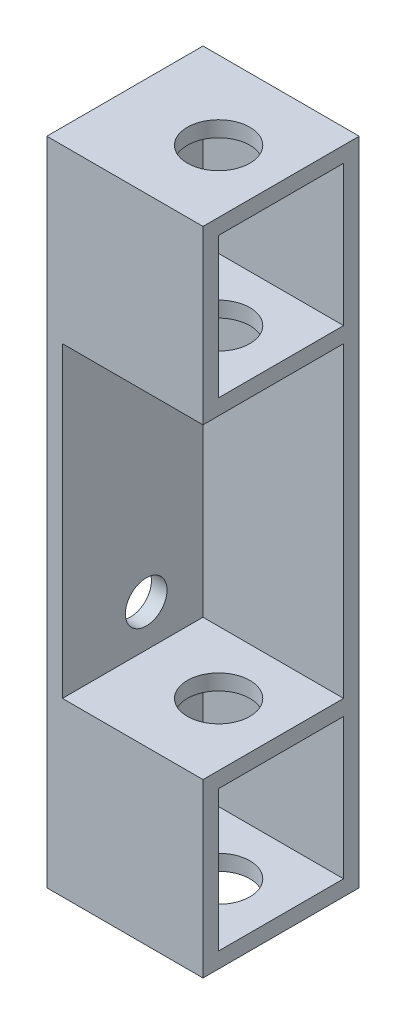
ISO-10303-21;
HEADER;
FILE_DESCRIPTION(('STEP AP214'),'2;1');
FILE_NAME('part.step','',(''),(''),'','','');
FILE_SCHEMA(('AUTOMOTIVE_DESIGN { 1 0 10303 214 1 1 1 1 }'));
ENDSEC;
DATA;
#1=APPLICATION_CONTEXT('core data for automotive mechanical design processes');
#2=APPLICATION_PROTOCOL_DEFINITION('international standard','automotive_design',2000,#1);
#3=PRODUCT_CONTEXT('',#1,'mechanical');
#4=PRODUCT('Part','Part','',(#3));
#5=PRODUCT_RELATED_PRODUCT_CATEGORY('part','',(#4));
#6=PRODUCT_DEFINITION_FORMATION('','',#4);
#7=PRODUCT_DEFINITION_CONTEXT('part definition',#1,'design');
#8=PRODUCT_DEFINITION('design','',#6,#7);
#9=PRODUCT_DEFINITION_SHAPE('','',#8);
#10=(LENGTH_UNIT() NAMED_UNIT(*) SI_UNIT(.MILLI.,.METRE.));
#11=(NAMED_UNIT(*) PLANE_ANGLE_UNIT() SI_UNIT($,.RADIAN.));
#12=(NAMED_UNIT(*) SI_UNIT($,.STERADIAN.) SOLID_ANGLE_UNIT());
#13=UNCERTAINTY_MEASURE_WITH_UNIT(LENGTH_MEASURE(1.E-05),#10,'distance_accuracy_value','');
#14=(GEOMETRIC_REPRESENTATION_CONTEXT(3) GLOBAL_UNCERTAINTY_ASSIGNED_CONTEXT((#13)) GLOBAL_UNIT_ASSIGNED_CONTEXT((#10,
#11,#12)) REPRESENTATION_CONTEXT('',''));
#15=CARTESIAN_POINT('',(0.,0.,0.));
#16=DIRECTION('',(0.,0.,1.));
#17=DIRECTION('',(1.,0.,0.));
#18=AXIS2_PLACEMENT_3D('',#15,#16,#17);
#19=CARTESIAN_POINT('',(-12.,0.,0.));
#20=DIRECTION('',(1.,0.,0.));
#21=DIRECTION('',(0.,0.,-1.));
#22=AXIS2_PLACEMENT_3D('',#19,#20,#21);
#23=PLANE('',#22);
#24=CARTESIAN_POINT('',(-12.,-21.5,-1.09322033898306));
#25=DIRECTION('',(1.,0.,0.));
#26=DIRECTION('',(0.,0.,-1.));
#27=AXIS2_PLACEMENT_3D('',#24,#25,#26);
#28=CIRCLE('',#27,4.);
#29=CARTESIAN_POINT('',(-12.,-21.5,-5.09322033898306));
#30=VERTEX_POINT('',#29);
#31=EDGE_CURVE('E487',#30,#30,#28,.T.);
#32=ORIENTED_EDGE('',*,*,#31,.F.);
#33=EDGE_LOOP('',(#32));
#34=FACE_BOUND('',#33,.T.);
#35=CARTESIAN_POINT('',(-12.,21.5,1.09322033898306));
#36=DIRECTION('',(1.,0.,0.));
#37=DIRECTION('',(0.,0.,-1.));
#38=AXIS2_PLACEMENT_3D('',#35,#36,#37);
#39=CIRCLE('',#38,4.);
#40=CARTESIAN_POINT('',(-12.,21.5,-2.90677966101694));
#41=VERTEX_POINT('',#40);
#42=EDGE_CURVE('E479',#41,#41,#39,.T.);
#43=ORIENTED_EDGE('',*,*,#42,.F.);
#44=EDGE_LOOP('',(#43));
#45=FACE_BOUND('',#44,.T.);
#46=DIRECTION('',(0.,-1.,0.));
#47=VECTOR('',#46,1.);
#48=CARTESIAN_POINT('',(-12.,62.5,-12.));
#49=LINE('',#48,#47);
#50=CARTESIAN_POINT('',(-12.,29.5,-12.));
#51=VERTEX_POINT('',#50);
#52=CARTESIAN_POINT('',(-12.,-29.5,-12.));
#53=VERTEX_POINT('',#52);
#54=EDGE_CURVE('E291',#51,#53,#49,.T.);
#55=ORIENTED_EDGE('',*,*,#54,.F.);
#56=DIRECTION('',(0.,0.,-1.));
#57=VECTOR('',#56,1.);
#58=CARTESIAN_POINT('',(-12.,29.5,15.));
#59=LINE('',#58,#57);
#60=CARTESIAN_POINT('',(-12.,29.5,15.));
#61=VERTEX_POINT('',#60);
#62=EDGE_CURVE('E178',#61,#51,#59,.T.);
#63=ORIENTED_EDGE('',*,*,#62,.F.);
#64=DIRECTION('',(0.,-1.,0.));
#65=VECTOR('',#64,1.);
#66=CARTESIAN_POINT('',(-12.,62.5,15.));
#67=LINE('',#66,#65);
#68=CARTESIAN_POINT('',(-12.,-29.5,15.));
#69=VERTEX_POINT('',#68);
#70=EDGE_CURVE('E174',#61,#69,#67,.T.);
#71=ORIENTED_EDGE('',*,*,#70,.T.);
#72=DIRECTION('',(0.,0.,1.));
#73=VECTOR('',#72,1.);
#74=CARTESIAN_POINT('',(-12.,-29.5,15.));
#75=LINE('',#74,#73);
#76=EDGE_CURVE('E210',#53,#69,#75,.T.);
#77=ORIENTED_EDGE('',*,*,#76,.F.);
#78=EDGE_LOOP('',(#55,#63,#71,#77));
#79=FACE_BOUND('',#78,.T.);
#80=ADVANCED_FACE('F39',(#34,#45,#79),#23,.T.);
#81=CARTESIAN_POINT('',(15.,62.5,-12.));
#82=DIRECTION('',(0.,0.,-1.));
#83=DIRECTION('',(0.,1.,0.));
#84=AXIS2_PLACEMENT_3D('',#81,#82,#83);
#85=PLANE('',#84);
#86=DIRECTION('',(1.,0.,0.));
#87=VECTOR('',#86,1.);
#88=CARTESIAN_POINT('',(15.,29.5,-12.));
#89=LINE('',#88,#87);
#90=CARTESIAN_POINT('',(15.,29.5,-12.));
#91=VERTEX_POINT('',#90);
#92=EDGE_CURVE('E56',#51,#91,#89,.T.);
#93=ORIENTED_EDGE('',*,*,#92,.F.);
#94=ORIENTED_EDGE('',*,*,#54,.T.);
#95=DIRECTION('',(-1.,0.,0.));
#96=VECTOR('',#95,1.);
#97=CARTESIAN_POINT('',(15.,-29.5,-12.));
#98=LINE('',#97,#96);
#99=CARTESIAN_POINT('',(15.,-29.5,-12.));
#100=VERTEX_POINT('',#99);
#101=EDGE_CURVE('E205',#100,#53,#98,.T.);
#102=ORIENTED_EDGE('',*,*,#101,.F.);
#103=DIRECTION('',(0.,-1.,0.));
#104=VECTOR('',#103,1.);
#105=CARTESIAN_POINT('',(15.,62.5,-12.));
#106=LINE('',#105,#104);
#107=EDGE_CURVE('E284',#91,#100,#106,.T.);
#108=ORIENTED_EDGE('',*,*,#107,.F.);
#109=EDGE_LOOP('',(#93,#94,#102,#108));
#110=FACE_BOUND('',#109,.T.);
#111=ADVANCED_FACE('F351',(#110),#85,.F.);
#112=CARTESIAN_POINT('',(-12.,-32.5,-12.));
#113=VERTEX_POINT('',#112);
#114=CARTESIAN_POINT('',(-12.,-59.5,-12.));
#115=VERTEX_POINT('',#114);
#116=EDGE_CURVE('E271',#113,#115,#49,.T.);
#117=ORIENTED_EDGE('',*,*,#116,.F.);
#118=DIRECTION('',(0.,0.,1.));
#119=VECTOR('',#118,1.);
#120=CARTESIAN_POINT('',(-12.,-32.5,15.));
#121=LINE('',#120,#119);
#122=CARTESIAN_POINT('',(-12.,-32.5,12.));
#123=VERTEX_POINT('',#122);
#124=EDGE_CURVE('E206',#113,#123,#121,.T.);
#125=ORIENTED_EDGE('',*,*,#124,.T.);
#126=DIRECTION('',(0.,1.,0.));
#127=VECTOR('',#126,1.);
#128=CARTESIAN_POINT('',(-12.,0.,12.));
#129=LINE('',#128,#127);
#130=CARTESIAN_POINT('',(-12.,-59.5,12.));
#131=VERTEX_POINT('',#130);
#132=EDGE_CURVE('E246',#131,#123,#129,.T.);
#133=ORIENTED_EDGE('',*,*,#132,.F.);
#134=DIRECTION('',(0.,0.,1.));
#135=VECTOR('',#134,1.);
#136=CARTESIAN_POINT('',(-12.,-59.5,0.));
#137=LINE('',#136,#135);
#138=EDGE_CURVE('E231',#115,#131,#137,.T.);
#139=ORIENTED_EDGE('',*,*,#138,.F.);
#140=EDGE_LOOP('',(#117,#125,#133,#139));
#141=FACE_BOUND('',#140,.T.);
#142=ADVANCED_FACE('F354',(#141),#23,.T.);
#143=DIRECTION('',(-1.,0.,0.));
#144=VECTOR('',#143,1.);
#145=CARTESIAN_POINT('',(15.,-32.5,-12.));
#146=LINE('',#145,#144);
#147=CARTESIAN_POINT('',(15.,-32.5,-12.));
#148=VERTEX_POINT('',#147);
#149=EDGE_CURVE('E222',#148,#113,#146,.T.);
#150=ORIENTED_EDGE('',*,*,#149,.T.);
#151=ORIENTED_EDGE('',*,*,#116,.T.);
#152=DIRECTION('',(1.,0.,0.));
#153=VECTOR('',#152,1.);
#154=CARTESIAN_POINT('',(15.,-59.5,-12.));
#155=LINE('',#154,#153);
#156=CARTESIAN_POINT('',(15.,-59.5,-12.));
#157=VERTEX_POINT('',#156);
#158=EDGE_CURVE('E234',#115,#157,#155,.T.);
#159=ORIENTED_EDGE('',*,*,#158,.T.);
#160=EDGE_CURVE('E278',#148,#157,#106,.T.);
#161=ORIENTED_EDGE('',*,*,#160,.F.);
#162=EDGE_LOOP('',(#150,#151,#159,#161));
#163=FACE_BOUND('',#162,.T.);
#164=ADVANCED_FACE('F359',(#163),#85,.F.);
#165=DIRECTION('',(0.,0.,-1.));
#166=VECTOR('',#165,1.);
#167=CARTESIAN_POINT('',(-12.,32.5,15.));
#168=LINE('',#167,#166);
#169=CARTESIAN_POINT('',(-12.,32.5,12.));
#170=VERTEX_POINT('',#169);
#171=CARTESIAN_POINT('',(-12.,32.5,-12.));
#172=VERTEX_POINT('',#171);
#173=EDGE_CURVE('E64',#170,#172,#168,.T.);
#174=ORIENTED_EDGE('',*,*,#173,.T.);
#175=CARTESIAN_POINT('',(-12.,59.5,-12.));
#176=VERTEX_POINT('',#175);
#177=EDGE_CURVE('E275',#176,#172,#49,.T.);
#178=ORIENTED_EDGE('',*,*,#177,.F.);
#179=DIRECTION('',(0.,0.,1.));
#180=VECTOR('',#179,1.);
#181=CARTESIAN_POINT('',(-12.,59.5,0.));
#182=LINE('',#181,#180);
#183=CARTESIAN_POINT('',(-12.,59.5,12.));
#184=VERTEX_POINT('',#183);
#185=EDGE_CURVE('E267',#176,#184,#182,.T.);
#186=ORIENTED_EDGE('',*,*,#185,.T.);
#187=DIRECTION('',(0.,1.,0.));
#188=VECTOR('',#187,1.);
#189=CARTESIAN_POINT('',(-12.,0.,12.));
#190=LINE('',#189,#188);
#191=EDGE_CURVE('E259',#170,#184,#190,.T.);
#192=ORIENTED_EDGE('',*,*,#191,.F.);
#193=EDGE_LOOP('',(#174,#178,#186,#192));
#194=FACE_BOUND('',#193,.T.);
#195=ADVANCED_FACE('F327',(#194),#23,.T.);
#196=ORIENTED_EDGE('',*,*,#177,.T.);
#197=DIRECTION('',(1.,0.,0.));
#198=VECTOR('',#197,1.);
#199=CARTESIAN_POINT('',(15.,32.5,-12.));
#200=LINE('',#199,#198);
#201=CARTESIAN_POINT('',(15.,32.5,-12.));
#202=VERTEX_POINT('',#201);
#203=EDGE_CURVE('E182',#172,#202,#200,.T.);
#204=ORIENTED_EDGE('',*,*,#203,.T.);
#205=CARTESIAN_POINT('',(15.,59.5,-12.));
#206=VERTEX_POINT('',#205);
#207=EDGE_CURVE('E279',#206,#202,#106,.T.);
#208=ORIENTED_EDGE('',*,*,#207,.F.);
#209=DIRECTION('',(1.,0.,0.));
#210=VECTOR('',#209,1.);
#211=CARTESIAN_POINT('',(15.,59.5,-12.));
#212=LINE('',#211,#210);
#213=EDGE_CURVE('E166',#176,#206,#212,.T.);
#214=ORIENTED_EDGE('',*,*,#213,.F.);
#215=EDGE_LOOP('',(#196,#204,#208,#214));
#216=FACE_BOUND('',#215,.T.);
#217=ADVANCED_FACE('F330',(#216),#85,.F.);
#218=CARTESIAN_POINT('',(-12.,62.5,-15.));
#219=DIRECTION('',(0.,0.,1.));
#220=DIRECTION('',(0.,-1.,0.));
#221=AXIS2_PLACEMENT_3D('',#218,#219,#220);
#222=PLANE('',#221);
#223=DIRECTION('',(-1.,0.,0.));
#224=VECTOR('',#223,1.);
#225=CARTESIAN_POINT('',(-12.,62.5,-15.));
#226=LINE('',#225,#224);
#227=CARTESIAN_POINT('',(15.,62.5,-15.));
#228=VERTEX_POINT('',#227);
#229=CARTESIAN_POINT('',(-15.,62.5,-15.));
#230=VERTEX_POINT('',#229);
#231=EDGE_CURVE('E316',#228,#230,#226,.T.);
#232=ORIENTED_EDGE('',*,*,#231,.F.);
#233=DIRECTION('',(0.,1.,0.));
#234=VECTOR('',#233,1.);
#235=CARTESIAN_POINT('',(15.,62.5,-15.));
#236=LINE('',#235,#234);
#237=CARTESIAN_POINT('',(15.,-62.5,-15.));
#238=VERTEX_POINT('',#237);
#239=EDGE_CURVE('E272',#238,#228,#236,.T.);
#240=ORIENTED_EDGE('',*,*,#239,.F.);
#241=DIRECTION('',(-1.,0.,0.));
#242=VECTOR('',#241,1.);
#243=CARTESIAN_POINT('',(-12.,-62.5,-15.));
#244=LINE('',#243,#242);
#245=CARTESIAN_POINT('',(-15.,-62.5,-15.));
#246=VERTEX_POINT('',#245);
#247=EDGE_CURVE('E294',#238,#246,#244,.T.);
#248=ORIENTED_EDGE('',*,*,#247,.T.);
#249=DIRECTION('',(0.,1.,0.));
#250=VECTOR('',#249,1.);
#251=CARTESIAN_POINT('',(-15.,62.5,-15.));
#252=LINE('',#251,#250);
#253=EDGE_CURVE('E288',#246,#230,#252,.T.);
#254=ORIENTED_EDGE('',*,*,#253,.T.);
#255=EDGE_LOOP('',(#232,#240,#248,#254));
#256=FACE_BOUND('',#255,.T.);
#257=ADVANCED_FACE('F41',(#256),#222,.F.);
#258=CARTESIAN_POINT('',(-12.,62.5,15.));
#259=DIRECTION('',(0.,-1.,0.));
#260=DIRECTION('',(0.,0.,-1.));
#261=AXIS2_PLACEMENT_3D('',#258,#259,#260);
#262=PLANE('',#261);
#263=CARTESIAN_POINT('',(3.,62.5,0.));
#264=DIRECTION('',(0.,1.,0.));
#265=DIRECTION('',(0.,0.,1.));
#266=AXIS2_PLACEMENT_3D('',#263,#264,#265);
#267=CIRCLE('',#266,6.);
#268=CARTESIAN_POINT('',(3.,62.5,6.));
#269=VERTEX_POINT('',#268);
#270=EDGE_CURVE('E400',#269,#269,#267,.T.);
#271=ORIENTED_EDGE('',*,*,#270,.F.);
#272=EDGE_LOOP('',(#271));
#273=FACE_BOUND('',#272,.T.);
#274=DIRECTION('',(0.,0.,1.));
#275=VECTOR('',#274,1.);
#276=CARTESIAN_POINT('',(-15.,62.5,15.));
#277=LINE('',#276,#275);
#278=CARTESIAN_POINT('',(-15.,62.5,15.));
#279=VERTEX_POINT('',#278);
#280=EDGE_CURVE('E298',#230,#279,#277,.T.);
#281=ORIENTED_EDGE('',*,*,#280,.T.);
#282=DIRECTION('',(-1.,0.,0.));
#283=VECTOR('',#282,1.);
#284=CARTESIAN_POINT('',(-12.,62.5,15.));
#285=LINE('',#284,#283);
#286=CARTESIAN_POINT('',(15.,62.5,15.));
#287=VERTEX_POINT('',#286);
#288=EDGE_CURVE('E313',#287,#279,#285,.T.);
#289=ORIENTED_EDGE('',*,*,#288,.F.);
#290=DIRECTION('',(0.,0.,1.));
#291=VECTOR('',#290,1.);
#292=CARTESIAN_POINT('',(15.,62.5,-15.));
#293=LINE('',#292,#291);
#294=EDGE_CURVE('E161',#228,#287,#293,.T.);
#295=ORIENTED_EDGE('',*,*,#294,.F.);
#296=ORIENTED_EDGE('',*,*,#231,.T.);
#297=EDGE_LOOP('',(#281,#289,#295,#296));
#298=FACE_BOUND('',#297,.T.);
#299=ADVANCED_FACE('F390',(#273,#298),#262,.F.);
#300=CARTESIAN_POINT('',(-12.,62.5,15.));
#301=DIRECTION('',(0.,0.,-1.));
#302=DIRECTION('',(0.,1.,0.));
#303=AXIS2_PLACEMENT_3D('',#300,#301,#302);
#304=PLANE('',#303);
#305=ORIENTED_EDGE('',*,*,#70,.F.);
#306=DIRECTION('',(-1.,0.,0.));
#307=VECTOR('',#306,1.);
#308=CARTESIAN_POINT('',(15.,29.5,15.));
#309=LINE('',#308,#307);
#310=CARTESIAN_POINT('',(15.,29.5,15.));
#311=VERTEX_POINT('',#310);
#312=EDGE_CURVE('E171',#311,#61,#309,.T.);
#313=ORIENTED_EDGE('',*,*,#312,.F.);
#314=DIRECTION('',(0.,1.,0.));
#315=VECTOR('',#314,1.);
#316=CARTESIAN_POINT('',(15.,59.5,15.));
#317=LINE('',#316,#315);
#318=EDGE_CURVE('E155',#311,#287,#317,.T.);
#319=ORIENTED_EDGE('',*,*,#318,.T.);
#320=ORIENTED_EDGE('',*,*,#288,.T.);
#321=DIRECTION('',(0.,-1.,0.));
#322=VECTOR('',#321,1.);
#323=CARTESIAN_POINT('',(-15.,62.5,15.));
#324=LINE('',#323,#322);
#325=CARTESIAN_POINT('',(-15.,-62.5,15.));
#326=VERTEX_POINT('',#325);
#327=EDGE_CURVE('E301',#279,#326,#324,.T.);
#328=ORIENTED_EDGE('',*,*,#327,.T.);
#329=DIRECTION('',(-1.,0.,0.));
#330=VECTOR('',#329,1.);
#331=CARTESIAN_POINT('',(-12.,-62.5,15.));
#332=LINE('',#331,#330);
#333=CARTESIAN_POINT('',(15.,-62.5,15.));
#334=VERTEX_POINT('',#333);
#335=EDGE_CURVE('E309',#334,#326,#332,.T.);
#336=ORIENTED_EDGE('',*,*,#335,.F.);
#337=DIRECTION('',(0.,1.,0.));
#338=VECTOR('',#337,1.);
#339=CARTESIAN_POINT('',(15.,-62.5,15.));
#340=LINE('',#339,#338);
#341=CARTESIAN_POINT('',(15.,-29.5,15.));
#342=VERTEX_POINT('',#341);
#343=EDGE_CURVE('E238',#334,#342,#340,.T.);
#344=ORIENTED_EDGE('',*,*,#343,.T.);
#345=DIRECTION('',(1.,0.,0.));
#346=VECTOR('',#345,1.);
#347=CARTESIAN_POINT('',(15.,-29.5,15.));
#348=LINE('',#347,#346);
#349=EDGE_CURVE('E214',#69,#342,#348,.T.);
#350=ORIENTED_EDGE('',*,*,#349,.F.);
#351=EDGE_LOOP('',(#305,#313,#319,#320,#328,#336,#344,#350));
#352=FACE_BOUND('',#351,.T.);
#353=ADVANCED_FACE('F172',(#352),#304,.F.);
#354=CARTESIAN_POINT('',(-12.,-62.5,15.));
#355=DIRECTION('',(0.,1.,0.));
#356=DIRECTION('',(0.,0.,1.));
#357=AXIS2_PLACEMENT_3D('',#354,#355,#356);
#358=PLANE('',#357);
#359=CARTESIAN_POINT('',(3.,-62.5,0.));
#360=DIRECTION('',(0.,1.,0.));
#361=DIRECTION('',(0.,0.,1.));
#362=AXIS2_PLACEMENT_3D('',#359,#360,#361);
#363=CIRCLE('',#362,6.);
#364=CARTESIAN_POINT('',(3.,-62.5,6.));
#365=VERTEX_POINT('',#364);
#366=EDGE_CURVE('E474',#365,#365,#363,.T.);
#367=ORIENTED_EDGE('',*,*,#366,.T.);
#368=EDGE_LOOP('',(#367));
#369=FACE_BOUND('',#368,.T.);
#370=DIRECTION('',(0.,0.,-1.));
#371=VECTOR('',#370,1.);
#372=CARTESIAN_POINT('',(15.,-62.5,-15.));
#373=LINE('',#372,#371);
#374=EDGE_CURVE('E283',#334,#238,#373,.T.);
#375=ORIENTED_EDGE('',*,*,#374,.F.);
#376=ORIENTED_EDGE('',*,*,#335,.T.);
#377=DIRECTION('',(0.,0.,-1.));
#378=VECTOR('',#377,1.);
#379=CARTESIAN_POINT('',(-15.,-62.5,15.));
#380=LINE('',#379,#378);
#381=EDGE_CURVE('E295',#326,#246,#380,.T.);
#382=ORIENTED_EDGE('',*,*,#381,.T.);
#383=ORIENTED_EDGE('',*,*,#247,.F.);
#384=EDGE_LOOP('',(#375,#376,#382,#383));
#385=FACE_BOUND('',#384,.T.);
#386=ADVANCED_FACE('F379',(#369,#385),#358,.F.);
#387=CARTESIAN_POINT('',(-15.,0.,0.));
#388=DIRECTION('',(1.,0.,0.));
#389=DIRECTION('',(0.,0.,-1.));
#390=AXIS2_PLACEMENT_3D('',#387,#388,#389);
#391=PLANE('',#390);
#392=CARTESIAN_POINT('',(-15.,-21.5,-1.09322033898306));
#393=DIRECTION('',(1.,0.,0.));
#394=DIRECTION('',(0.,0.,-1.));
#395=AXIS2_PLACEMENT_3D('',#392,#393,#394);
#396=CIRCLE('',#395,4.);
#397=CARTESIAN_POINT('',(-15.,-21.5,-5.09322033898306));
#398=VERTEX_POINT('',#397);
#399=EDGE_CURVE('E475',#398,#398,#396,.T.);
#400=ORIENTED_EDGE('',*,*,#399,.T.);
#401=EDGE_LOOP('',(#400));
#402=FACE_BOUND('',#401,.T.);
#403=CARTESIAN_POINT('',(-15.,21.5,1.09322033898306));
#404=DIRECTION('',(1.,0.,0.));
#405=DIRECTION('',(0.,0.,-1.));
#406=AXIS2_PLACEMENT_3D('',#403,#404,#405);
#407=CIRCLE('',#406,4.);
#408=CARTESIAN_POINT('',(-15.,21.5,-2.90677966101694));
#409=VERTEX_POINT('',#408);
#410=EDGE_CURVE('E483',#409,#409,#407,.T.);
#411=ORIENTED_EDGE('',*,*,#410,.T.);
#412=EDGE_LOOP('',(#411));
#413=FACE_BOUND('',#412,.T.);
#414=ORIENTED_EDGE('',*,*,#280,.F.);
#415=ORIENTED_EDGE('',*,*,#253,.F.);
#416=ORIENTED_EDGE('',*,*,#381,.F.);
#417=ORIENTED_EDGE('',*,*,#327,.F.);
#418=EDGE_LOOP('',(#414,#415,#416,#417));
#419=FACE_BOUND('',#418,.T.);
#420=ADVANCED_FACE('F375',(#402,#413,#419),#391,.F.);
#421=CARTESIAN_POINT('',(15.,0.,0.));
#422=DIRECTION('',(-1.,0.,0.));
#423=DIRECTION('',(0.,0.,1.));
#424=AXIS2_PLACEMENT_3D('',#421,#422,#423);
#425=PLANE('',#424);
#426=ORIENTED_EDGE('',*,*,#207,.T.);
#427=DIRECTION('',(0.,0.,1.));
#428=VECTOR('',#427,1.);
#429=CARTESIAN_POINT('',(15.,32.5,15.));
#430=LINE('',#429,#428);
#431=CARTESIAN_POINT('',(15.,32.5,12.));
#432=VERTEX_POINT('',#431);
#433=EDGE_CURVE('E195',#202,#432,#430,.T.);
#434=ORIENTED_EDGE('',*,*,#433,.T.);
#435=DIRECTION('',(0.,1.,0.));
#436=VECTOR('',#435,1.);
#437=CARTESIAN_POINT('',(15.,62.5,12.));
#438=LINE('',#437,#436);
#439=CARTESIAN_POINT('',(15.,59.5,12.));
#440=VERTEX_POINT('',#439);
#441=EDGE_CURVE('E251',#432,#440,#438,.T.);
#442=ORIENTED_EDGE('',*,*,#441,.T.);
#443=DIRECTION('',(0.,0.,-1.));
#444=VECTOR('',#443,1.);
#445=CARTESIAN_POINT('',(15.,59.5,-15.));
#446=LINE('',#445,#444);
#447=EDGE_CURVE('E167',#440,#206,#446,.T.);
#448=ORIENTED_EDGE('',*,*,#447,.T.);
#449=EDGE_LOOP('',(#426,#434,#442,#448));
#450=FACE_BOUND('',#449,.T.);
#451=DIRECTION('',(0.,0.,-1.));
#452=VECTOR('',#451,1.);
#453=CARTESIAN_POINT('',(15.,-32.5,15.));
#454=LINE('',#453,#452);
#455=CARTESIAN_POINT('',(15.,-32.5,12.));
#456=VERTEX_POINT('',#455);
#457=EDGE_CURVE('E194',#456,#148,#454,.T.);
#458=ORIENTED_EDGE('',*,*,#457,.T.);
#459=ORIENTED_EDGE('',*,*,#160,.T.);
#460=DIRECTION('',(0.,0.,1.));
#461=VECTOR('',#460,1.);
#462=CARTESIAN_POINT('',(15.,-59.5,15.));
#463=LINE('',#462,#461);
#464=CARTESIAN_POINT('',(15.,-59.5,12.));
#465=VERTEX_POINT('',#464);
#466=EDGE_CURVE('E218',#157,#465,#463,.T.);
#467=ORIENTED_EDGE('',*,*,#466,.T.);
#468=DIRECTION('',(0.,1.,0.));
#469=VECTOR('',#468,1.);
#470=CARTESIAN_POINT('',(15.,-62.5,12.));
#471=LINE('',#470,#469);
#472=EDGE_CURVE('E239',#465,#456,#471,.T.);
#473=ORIENTED_EDGE('',*,*,#472,.T.);
#474=EDGE_LOOP('',(#458,#459,#467,#473));
#475=FACE_BOUND('',#474,.T.);
#476=DIRECTION('',(0.,0.,1.));
#477=VECTOR('',#476,1.);
#478=CARTESIAN_POINT('',(15.,29.5,15.));
#479=LINE('',#478,#477);
#480=EDGE_CURVE('E159',#91,#311,#479,.T.);
#481=ORIENTED_EDGE('',*,*,#480,.F.);
#482=ORIENTED_EDGE('',*,*,#107,.T.);
#483=DIRECTION('',(0.,0.,-1.));
#484=VECTOR('',#483,1.);
#485=CARTESIAN_POINT('',(15.,-29.5,15.));
#486=LINE('',#485,#484);
#487=EDGE_CURVE('E201',#342,#100,#486,.T.);
#488=ORIENTED_EDGE('',*,*,#487,.F.);
#489=ORIENTED_EDGE('',*,*,#343,.F.);
#490=ORIENTED_EDGE('',*,*,#374,.T.);
#491=ORIENTED_EDGE('',*,*,#239,.T.);
#492=ORIENTED_EDGE('',*,*,#294,.T.);
#493=ORIENTED_EDGE('',*,*,#318,.F.);
#494=EDGE_LOOP('',(#481,#482,#488,#489,#490,#491,#492,#493));
#495=FACE_BOUND('',#494,.T.);
#496=ADVANCED_FACE('F157',(#450,#475,#495),#425,.F.);
#497=CARTESIAN_POINT('',(0.,59.5,0.));
#498=DIRECTION('',(0.,1.,0.));
#499=DIRECTION('',(0.,0.,1.));
#500=AXIS2_PLACEMENT_3D('',#497,#498,#499);
#501=PLANE('',#500);
#502=CARTESIAN_POINT('',(3.,59.5,0.));
#503=DIRECTION('',(0.,1.,0.));
#504=DIRECTION('',(0.,0.,1.));
#505=AXIS2_PLACEMENT_3D('',#502,#503,#504);
#506=CIRCLE('',#505,6.);
#507=CARTESIAN_POINT('',(3.,59.5,6.));
#508=VERTEX_POINT('',#507);
#509=EDGE_CURVE('E187',#508,#508,#506,.T.);
#510=ORIENTED_EDGE('',*,*,#509,.T.);
#511=EDGE_LOOP('',(#510));
#512=FACE_BOUND('',#511,.T.);
#513=ORIENTED_EDGE('',*,*,#447,.F.);
#514=DIRECTION('',(-1.,0.,0.));
#515=VECTOR('',#514,1.);
#516=CARTESIAN_POINT('',(0.,59.5,12.));
#517=LINE('',#516,#515);
#518=EDGE_CURVE('E49',#440,#184,#517,.T.);
#519=ORIENTED_EDGE('',*,*,#518,.T.);
#520=ORIENTED_EDGE('',*,*,#185,.F.);
#521=ORIENTED_EDGE('',*,*,#213,.T.);
#522=EDGE_LOOP('',(#513,#519,#520,#521));
#523=FACE_BOUND('',#522,.T.);
#524=ADVANCED_FACE('F325',(#512,#523),#501,.F.);
#525=CARTESIAN_POINT('',(0.,0.,12.));
#526=DIRECTION('',(0.,0.,-1.));
#527=DIRECTION('',(-1.,0.,0.));
#528=AXIS2_PLACEMENT_3D('',#525,#526,#527);
#529=PLANE('',#528);
#530=DIRECTION('',(1.,0.,0.));
#531=VECTOR('',#530,1.);
#532=CARTESIAN_POINT('',(15.,32.5,12.));
#533=LINE('',#532,#531);
#534=EDGE_CURVE('E255',#170,#432,#533,.T.);
#535=ORIENTED_EDGE('',*,*,#534,.F.);
#536=ORIENTED_EDGE('',*,*,#191,.T.);
#537=ORIENTED_EDGE('',*,*,#518,.F.);
#538=ORIENTED_EDGE('',*,*,#441,.F.);
#539=EDGE_LOOP('',(#535,#536,#537,#538));
#540=FACE_BOUND('',#539,.T.);
#541=ADVANCED_FACE('F337',(#540),#529,.T.);
#542=CARTESIAN_POINT('',(0.,0.,12.));
#543=DIRECTION('',(0.,0.,-1.));
#544=DIRECTION('',(-1.,0.,0.));
#545=AXIS2_PLACEMENT_3D('',#542,#543,#544);
#546=PLANE('',#545);
#547=DIRECTION('',(1.,0.,0.));
#548=VECTOR('',#547,1.);
#549=CARTESIAN_POINT('',(0.,-59.5,12.));
#550=LINE('',#549,#548);
#551=EDGE_CURVE('E11',#131,#465,#550,.T.);
#552=ORIENTED_EDGE('',*,*,#551,.F.);
#553=ORIENTED_EDGE('',*,*,#132,.T.);
#554=DIRECTION('',(-1.,0.,0.));
#555=VECTOR('',#554,1.);
#556=CARTESIAN_POINT('',(-15.,-32.5,12.));
#557=LINE('',#556,#555);
#558=EDGE_CURVE('E242',#456,#123,#557,.T.);
#559=ORIENTED_EDGE('',*,*,#558,.F.);
#560=ORIENTED_EDGE('',*,*,#472,.F.);
#561=EDGE_LOOP('',(#552,#553,#559,#560));
#562=FACE_BOUND('',#561,.T.);
#563=ADVANCED_FACE('F339',(#562),#546,.T.);
#564=CARTESIAN_POINT('',(0.,-59.5,0.));
#565=DIRECTION('',(0.,1.,0.));
#566=DIRECTION('',(0.,0.,1.));
#567=AXIS2_PLACEMENT_3D('',#564,#565,#566);
#568=PLANE('',#567);
#569=CARTESIAN_POINT('',(3.,-59.5,0.));
#570=DIRECTION('',(0.,1.,0.));
#571=DIRECTION('',(0.,0.,1.));
#572=AXIS2_PLACEMENT_3D('',#569,#570,#571);
#573=CIRCLE('',#572,6.);
#574=CARTESIAN_POINT('',(3.,-59.5,6.));
#575=VERTEX_POINT('',#574);
#576=EDGE_CURVE('E455',#575,#575,#573,.T.);
#577=ORIENTED_EDGE('',*,*,#576,.F.);
#578=EDGE_LOOP('',(#577));
#579=FACE_BOUND('',#578,.T.);
#580=ORIENTED_EDGE('',*,*,#158,.F.);
#581=ORIENTED_EDGE('',*,*,#138,.T.);
#582=ORIENTED_EDGE('',*,*,#551,.T.);
#583=ORIENTED_EDGE('',*,*,#466,.F.);
#584=EDGE_LOOP('',(#580,#581,#582,#583));
#585=FACE_BOUND('',#584,.T.);
#586=ADVANCED_FACE('F345',(#579,#585),#568,.T.);
#587=CARTESIAN_POINT('',(0.,-29.5,0.));
#588=DIRECTION('',(0.,1.,0.));
#589=DIRECTION('',(0.,0.,1.));
#590=AXIS2_PLACEMENT_3D('',#587,#588,#589);
#591=PLANE('',#590);
#592=CARTESIAN_POINT('',(3.,-29.5,0.));
#593=DIRECTION('',(0.,1.,0.));
#594=DIRECTION('',(0.,0.,1.));
#595=AXIS2_PLACEMENT_3D('',#592,#593,#594);
#596=CIRCLE('',#595,6.);
#597=CARTESIAN_POINT('',(3.,-29.5,6.));
#598=VERTEX_POINT('',#597);
#599=EDGE_CURVE('E458',#598,#598,#596,.T.);
#600=ORIENTED_EDGE('',*,*,#599,.F.);
#601=EDGE_LOOP('',(#600));
#602=FACE_BOUND('',#601,.T.);
#603=ORIENTED_EDGE('',*,*,#487,.T.);
#604=ORIENTED_EDGE('',*,*,#101,.T.);
#605=ORIENTED_EDGE('',*,*,#76,.T.);
#606=ORIENTED_EDGE('',*,*,#349,.T.);
#607=EDGE_LOOP('',(#603,#604,#605,#606));
#608=FACE_BOUND('',#607,.T.);
#609=ADVANCED_FACE('F413',(#602,#608),#591,.T.);
#610=CARTESIAN_POINT('',(0.,-32.5,0.));
#611=DIRECTION('',(0.,1.,0.));
#612=DIRECTION('',(0.,0.,1.));
#613=AXIS2_PLACEMENT_3D('',#610,#611,#612);
#614=PLANE('',#613);
#615=CARTESIAN_POINT('',(3.,-32.5,0.));
#616=DIRECTION('',(0.,1.,0.));
#617=DIRECTION('',(0.,0.,1.));
#618=AXIS2_PLACEMENT_3D('',#615,#616,#617);
#619=CIRCLE('',#618,6.);
#620=CARTESIAN_POINT('',(3.,-32.5,6.));
#621=VERTEX_POINT('',#620);
#622=EDGE_CURVE('E463',#621,#621,#619,.T.);
#623=ORIENTED_EDGE('',*,*,#622,.T.);
#624=EDGE_LOOP('',(#623));
#625=FACE_BOUND('',#624,.T.);
#626=ORIENTED_EDGE('',*,*,#558,.T.);
#627=ORIENTED_EDGE('',*,*,#124,.F.);
#628=ORIENTED_EDGE('',*,*,#149,.F.);
#629=ORIENTED_EDGE('',*,*,#457,.F.);
#630=EDGE_LOOP('',(#626,#627,#628,#629));
#631=FACE_BOUND('',#630,.T.);
#632=ADVANCED_FACE('F434',(#625,#631),#614,.F.);
#633=CARTESIAN_POINT('',(0.,29.5,0.));
#634=DIRECTION('',(0.,1.,0.));
#635=DIRECTION('',(0.,0.,1.));
#636=AXIS2_PLACEMENT_3D('',#633,#634,#635);
#637=PLANE('',#636);
#638=CARTESIAN_POINT('',(3.,29.5,0.));
#639=DIRECTION('',(0.,1.,0.));
#640=DIRECTION('',(0.,0.,1.));
#641=AXIS2_PLACEMENT_3D('',#638,#639,#640);
#642=CIRCLE('',#641,6.);
#643=CARTESIAN_POINT('',(3.,29.5,6.));
#644=VERTEX_POINT('',#643);
#645=EDGE_CURVE('E468',#644,#644,#642,.T.);
#646=ORIENTED_EDGE('',*,*,#645,.T.);
#647=EDGE_LOOP('',(#646));
#648=FACE_BOUND('',#647,.T.);
#649=ORIENTED_EDGE('',*,*,#480,.T.);
#650=ORIENTED_EDGE('',*,*,#312,.T.);
#651=ORIENTED_EDGE('',*,*,#62,.T.);
#652=ORIENTED_EDGE('',*,*,#92,.T.);
#653=EDGE_LOOP('',(#649,#650,#651,#652));
#654=FACE_BOUND('',#653,.T.);
#655=ADVANCED_FACE('F180',(#648,#654),#637,.F.);
#656=CARTESIAN_POINT('',(0.,32.5,0.));
#657=DIRECTION('',(0.,1.,0.));
#658=DIRECTION('',(0.,0.,1.));
#659=AXIS2_PLACEMENT_3D('',#656,#657,#658);
#660=PLANE('',#659);
#661=CARTESIAN_POINT('',(3.,32.5,0.));
#662=DIRECTION('',(0.,1.,0.));
#663=DIRECTION('',(0.,0.,1.));
#664=AXIS2_PLACEMENT_3D('',#661,#662,#663);
#665=CIRCLE('',#664,6.);
#666=CARTESIAN_POINT('',(3.,32.5,6.));
#667=VERTEX_POINT('',#666);
#668=EDGE_CURVE('E43',#667,#667,#665,.T.);
#669=ORIENTED_EDGE('',*,*,#668,.F.);
#670=EDGE_LOOP('',(#669));
#671=FACE_BOUND('',#670,.T.);
#672=ORIENTED_EDGE('',*,*,#173,.F.);
#673=ORIENTED_EDGE('',*,*,#534,.T.);
#674=ORIENTED_EDGE('',*,*,#433,.F.);
#675=ORIENTED_EDGE('',*,*,#203,.F.);
#676=EDGE_LOOP('',(#672,#673,#674,#675));
#677=FACE_BOUND('',#676,.T.);
#678=ADVANCED_FACE('F334',(#671,#677),#660,.T.);
#679=CARTESIAN_POINT('',(3.,-62.5,0.));
#680=DIRECTION('',(0.,1.,0.));
#681=DIRECTION('',(0.,0.,1.));
#682=AXIS2_PLACEMENT_3D('',#679,#680,#681);
#683=CYLINDRICAL_SURFACE('',#682,6.);
#684=ORIENTED_EDGE('',*,*,#668,.T.);
#685=EDGE_LOOP('',(#684));
#686=FACE_BOUND('',#685,.T.);
#687=ORIENTED_EDGE('',*,*,#645,.F.);
#688=EDGE_LOOP('',(#687));
#689=FACE_BOUND('',#688,.T.);
#690=ADVANCED_FACE('F509',(#686,#689),#683,.F.);
#691=ORIENTED_EDGE('',*,*,#599,.T.);
#692=EDGE_LOOP('',(#691));
#693=FACE_BOUND('',#692,.T.);
#694=ORIENTED_EDGE('',*,*,#622,.F.);
#695=EDGE_LOOP('',(#694));
#696=FACE_BOUND('',#695,.T.);
#697=ADVANCED_FACE('F508',(#693,#696),#683,.F.);
#698=ORIENTED_EDGE('',*,*,#576,.T.);
#699=EDGE_LOOP('',(#698));
#700=FACE_BOUND('',#699,.T.);
#701=ORIENTED_EDGE('',*,*,#366,.F.);
#702=EDGE_LOOP('',(#701));
#703=FACE_BOUND('',#702,.T.);
#704=ADVANCED_FACE('F506',(#700,#703),#683,.F.);
#705=ORIENTED_EDGE('',*,*,#270,.T.);
#706=EDGE_LOOP('',(#705));
#707=FACE_BOUND('',#706,.T.);
#708=ORIENTED_EDGE('',*,*,#509,.F.);
#709=EDGE_LOOP('',(#708));
#710=FACE_BOUND('',#709,.T.);
#711=ADVANCED_FACE('F502',(#707,#710),#683,.F.);
#712=CARTESIAN_POINT('',(-15.,21.5,1.09322033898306));
#713=DIRECTION('',(1.,0.,0.));
#714=DIRECTION('',(0.,0.,-1.));
#715=AXIS2_PLACEMENT_3D('',#712,#713,#714);
#716=CYLINDRICAL_SURFACE('',#715,4.);
#717=ORIENTED_EDGE('',*,*,#410,.F.);
#718=EDGE_LOOP('',(#717));
#719=FACE_BOUND('',#718,.T.);
#720=ORIENTED_EDGE('',*,*,#42,.T.);
#721=EDGE_LOOP('',(#720));
#722=FACE_BOUND('',#721,.T.);
#723=ADVANCED_FACE('F497',(#719,#722),#716,.F.);
#724=CARTESIAN_POINT('',(-15.,-21.5,-1.09322033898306));
#725=DIRECTION('',(1.,0.,0.));
#726=DIRECTION('',(0.,0.,-1.));
#727=AXIS2_PLACEMENT_3D('',#724,#725,#726);
#728=CYLINDRICAL_SURFACE('',#727,4.);
#729=ORIENTED_EDGE('',*,*,#399,.F.);
#730=EDGE_LOOP('',(#729));
#731=FACE_BOUND('',#730,.T.);
#732=ORIENTED_EDGE('',*,*,#31,.T.);
#733=EDGE_LOOP('',(#732));
#734=FACE_BOUND('',#733,.T.);
#735=ADVANCED_FACE('F494',(#731,#734),#728,.F.);
#736=CLOSED_SHELL('',(#80,#111,#142,#164,#195,#217,#257,#299,#353,#386,#420,#496,#524,#541,#563,
#586,#609,#632,#655,#678,#690,#697,#704,#711,#723,#735));
#737=MANIFOLD_SOLID_BREP('B2',#736);
#738=ADVANCED_BREP_SHAPE_REPRESENTATION('',(#18,#737),#14);
#739=SHAPE_DEFINITION_REPRESENTATION(#9,#738);
ENDSEC;
END-ISO-10303-21;
